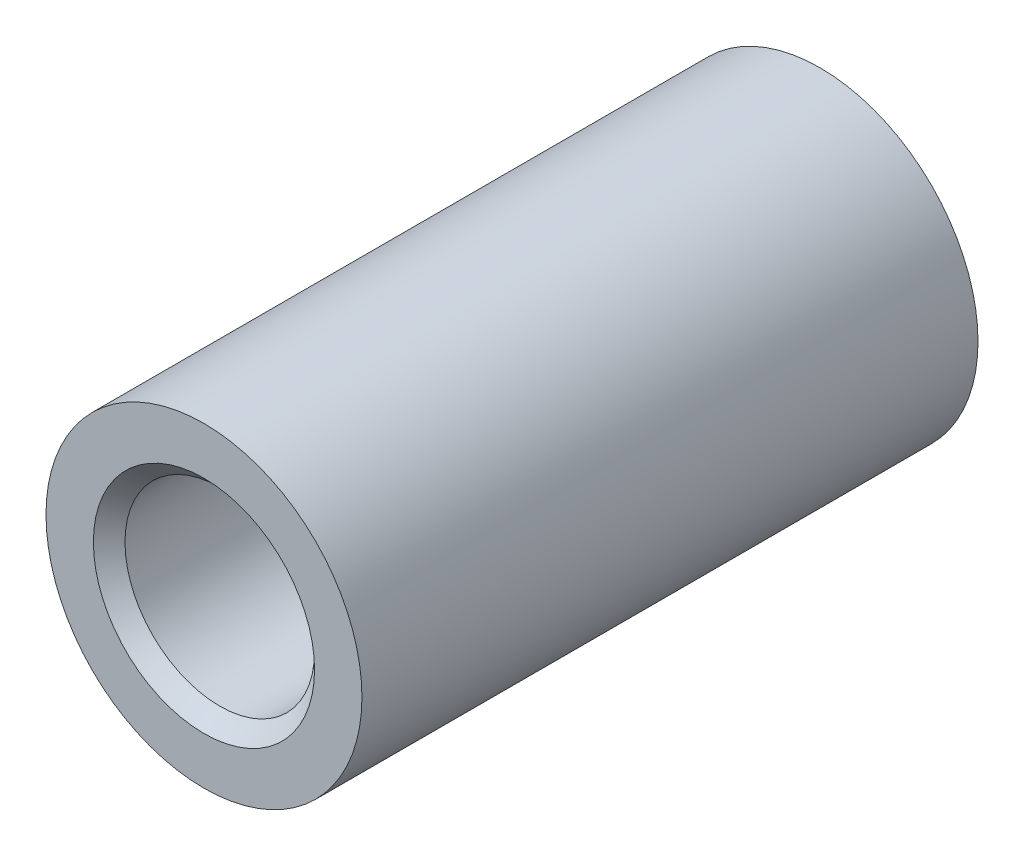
ISO-10303-21;
HEADER;
FILE_DESCRIPTION(('STEP AP214'),'2;1');
FILE_NAME('part.step','',(''),(''),'','','');
FILE_SCHEMA(('AUTOMOTIVE_DESIGN { 1 0 10303 214 1 1 1 1 }'));
ENDSEC;
DATA;
#1=APPLICATION_CONTEXT('core data for automotive mechanical design processes');
#2=APPLICATION_PROTOCOL_DEFINITION('international standard','automotive_design',2000,#1);
#3=PRODUCT_CONTEXT('',#1,'mechanical');
#4=PRODUCT('Part','Part','',(#3));
#5=PRODUCT_RELATED_PRODUCT_CATEGORY('part','',(#4));
#6=PRODUCT_DEFINITION_FORMATION('','',#4);
#7=PRODUCT_DEFINITION_CONTEXT('part definition',#1,'design');
#8=PRODUCT_DEFINITION('design','',#6,#7);
#9=PRODUCT_DEFINITION_SHAPE('','',#8);
#10=(LENGTH_UNIT() NAMED_UNIT(*) SI_UNIT(.MILLI.,.METRE.));
#11=(NAMED_UNIT(*) PLANE_ANGLE_UNIT() SI_UNIT($,.RADIAN.));
#12=(NAMED_UNIT(*) SI_UNIT($,.STERADIAN.) SOLID_ANGLE_UNIT());
#13=UNCERTAINTY_MEASURE_WITH_UNIT(LENGTH_MEASURE(1.E-05),#10,'distance_accuracy_value','');
#14=(GEOMETRIC_REPRESENTATION_CONTEXT(3) GLOBAL_UNCERTAINTY_ASSIGNED_CONTEXT((#13)) GLOBAL_UNIT_ASSIGNED_CONTEXT((#10,
#11,#12)) REPRESENTATION_CONTEXT('',''));
#15=CARTESIAN_POINT('',(0.,0.,0.));
#16=DIRECTION('',(0.,0.,1.));
#17=DIRECTION('',(1.,0.,0.));
#18=AXIS2_PLACEMENT_3D('',#15,#16,#17);
#19=CARTESIAN_POINT('',(0.,0.,-9.75));
#20=DIRECTION('',(0.,0.,1.));
#21=DIRECTION('',(1.,0.,0.));
#22=AXIS2_PLACEMENT_3D('',#19,#20,#21);
#23=CYLINDRICAL_SURFACE('',#22,5.);
#24=CARTESIAN_POINT('',(0.,0.,-9.75));
#25=DIRECTION('',(0.,0.,1.));
#26=DIRECTION('',(1.,0.,0.));
#27=AXIS2_PLACEMENT_3D('',#24,#25,#26);
#28=CIRCLE('',#27,5.);
#29=CARTESIAN_POINT('',(5.,0.,-9.75));
#30=VERTEX_POINT('',#29);
#31=EDGE_CURVE('E50',#30,#30,#28,.T.);
#32=ORIENTED_EDGE('',*,*,#31,.T.);
#33=EDGE_LOOP('',(#32));
#34=FACE_BOUND('',#33,.T.);
#35=CARTESIAN_POINT('',(0.,0.,9.75));
#36=DIRECTION('',(0.,0.,1.));
#37=DIRECTION('',(1.,0.,0.));
#38=AXIS2_PLACEMENT_3D('',#35,#36,#37);
#39=CIRCLE('',#38,5.);
#40=CARTESIAN_POINT('',(5.,0.,9.75));
#41=VERTEX_POINT('',#40);
#42=EDGE_CURVE('E53',#41,#41,#39,.T.);
#43=ORIENTED_EDGE('',*,*,#42,.F.);
#44=EDGE_LOOP('',(#43));
#45=FACE_BOUND('',#44,.T.);
#46=ADVANCED_FACE('F30',(#34,#45),#23,.T.);
#47=CARTESIAN_POINT('',(0.,0.,-9.75));
#48=DIRECTION('',(0.,0.,1.));
#49=DIRECTION('',(1.,0.,0.));
#50=AXIS2_PLACEMENT_3D('',#47,#48,#49);
#51=PLANE('',#50);
#52=CARTESIAN_POINT('',(0.,0.,-9.75));
#53=DIRECTION('',(0.,0.,1.));
#54=DIRECTION('',(1.,0.,0.));
#55=AXIS2_PLACEMENT_3D('',#52,#53,#54);
#56=CIRCLE('',#55,3.5);
#57=CARTESIAN_POINT('',(3.5,0.,-9.75));
#58=VERTEX_POINT('',#57);
#59=EDGE_CURVE('E45',#58,#58,#56,.T.);
#60=ORIENTED_EDGE('',*,*,#59,.T.);
#61=EDGE_LOOP('',(#60));
#62=FACE_BOUND('',#61,.T.);
#63=ORIENTED_EDGE('',*,*,#31,.F.);
#64=EDGE_LOOP('',(#63));
#65=FACE_BOUND('',#64,.T.);
#66=ADVANCED_FACE('F60',(#62,#65),#51,.F.);
#67=CARTESIAN_POINT('',(0.,0.,-9.75));
#68=DIRECTION('',(0.,0.,1.));
#69=DIRECTION('',(1.,0.,0.));
#70=AXIS2_PLACEMENT_3D('',#67,#68,#69);
#71=CYLINDRICAL_SURFACE('',#70,3.);
#72=CARTESIAN_POINT('',(0.,0.,-9.25));
#73=DIRECTION('',(0.,0.,1.));
#74=DIRECTION('',(1.,0.,0.));
#75=AXIS2_PLACEMENT_3D('',#72,#73,#74);
#76=CIRCLE('',#75,3.);
#77=CARTESIAN_POINT('',(3.,0.,-9.25));
#78=VERTEX_POINT('',#77);
#79=EDGE_CURVE('E37',#78,#78,#76,.F.);
#80=ORIENTED_EDGE('',*,*,#79,.T.);
#81=EDGE_LOOP('',(#80));
#82=FACE_BOUND('',#81,.T.);
#83=CARTESIAN_POINT('',(0.,0.,9.25));
#84=DIRECTION('',(0.,0.,1.));
#85=DIRECTION('',(1.,0.,0.));
#86=AXIS2_PLACEMENT_3D('',#83,#84,#85);
#87=CIRCLE('',#86,3.);
#88=CARTESIAN_POINT('',(3.,0.,9.25));
#89=VERTEX_POINT('',#88);
#90=EDGE_CURVE('E41',#89,#89,#87,.T.);
#91=ORIENTED_EDGE('',*,*,#90,.T.);
#92=EDGE_LOOP('',(#91));
#93=FACE_BOUND('',#92,.T.);
#94=ADVANCED_FACE('F66',(#82,#93),#71,.F.);
#95=CARTESIAN_POINT('',(0.,0.,9.75));
#96=DIRECTION('',(0.,0.,1.));
#97=DIRECTION('',(1.,0.,0.));
#98=AXIS2_PLACEMENT_3D('',#95,#96,#97);
#99=PLANE('',#98);
#100=CARTESIAN_POINT('',(0.,0.,9.75));
#101=DIRECTION('',(0.,0.,1.));
#102=DIRECTION('',(1.,0.,0.));
#103=AXIS2_PLACEMENT_3D('',#100,#101,#102);
#104=CIRCLE('',#103,3.5);
#105=CARTESIAN_POINT('',(3.5,0.,9.75));
#106=VERTEX_POINT('',#105);
#107=EDGE_CURVE('E10',#106,#106,#104,.F.);
#108=ORIENTED_EDGE('',*,*,#107,.T.);
#109=EDGE_LOOP('',(#108));
#110=FACE_BOUND('',#109,.T.);
#111=ORIENTED_EDGE('',*,*,#42,.T.);
#112=EDGE_LOOP('',(#111));
#113=FACE_BOUND('',#112,.T.);
#114=ADVANCED_FACE('F57',(#110,#113),#99,.T.);
#115=CARTESIAN_POINT('',(0.,0.,-9.75));
#116=DIRECTION('',(0.,0.,-1.));
#117=DIRECTION('',(-1.,0.,0.));
#118=AXIS2_PLACEMENT_3D('',#115,#116,#117);
#119=CONICAL_SURFACE('',#118,3.5,0.785398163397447);
#120=ORIENTED_EDGE('',*,*,#79,.F.);
#121=EDGE_LOOP('',(#120));
#122=FACE_BOUND('',#121,.T.);
#123=ORIENTED_EDGE('',*,*,#59,.F.);
#124=EDGE_LOOP('',(#123));
#125=FACE_BOUND('',#124,.T.);
#126=ADVANCED_FACE('F70',(#122,#125),#119,.F.);
#127=CARTESIAN_POINT('',(0.,0.,9.25));
#128=DIRECTION('',(0.,0.,1.));
#129=DIRECTION('',(1.,0.,0.));
#130=AXIS2_PLACEMENT_3D('',#127,#128,#129);
#131=CONICAL_SURFACE('',#130,3.,0.785398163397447);
#132=ORIENTED_EDGE('',*,*,#107,.F.);
#133=EDGE_LOOP('',(#132));
#134=FACE_BOUND('',#133,.T.);
#135=ORIENTED_EDGE('',*,*,#90,.F.);
#136=EDGE_LOOP('',(#135));
#137=FACE_BOUND('',#136,.T.);
#138=ADVANCED_FACE('F32',(#134,#137),#131,.F.);
#139=CLOSED_SHELL('',(#46,#66,#94,#114,#126,#138));
#140=MANIFOLD_SOLID_BREP('B2',#139);
#141=ADVANCED_BREP_SHAPE_REPRESENTATION('',(#18,#140),#14);
#142=SHAPE_DEFINITION_REPRESENTATION(#9,#141);
ENDSEC;
END-ISO-10303-21;
